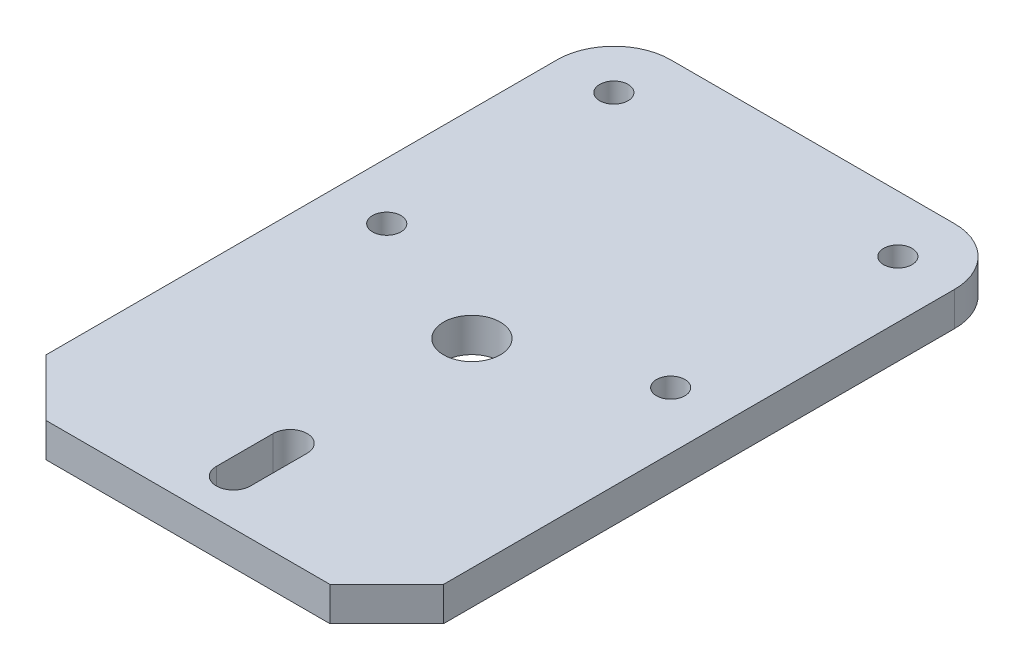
ISO-10303-21;
HEADER;
FILE_DESCRIPTION(('STEP AP214'),'2;1');
FILE_NAME('part.step','',(''),(''),'','','');
FILE_SCHEMA(('AUTOMOTIVE_DESIGN { 1 0 10303 214 1 1 1 1 }'));
ENDSEC;
DATA;
#1=APPLICATION_CONTEXT('core data for automotive mechanical design processes');
#2=APPLICATION_PROTOCOL_DEFINITION('international standard','automotive_design',2000,#1);
#3=PRODUCT_CONTEXT('',#1,'mechanical');
#4=PRODUCT('Part','Part','',(#3));
#5=PRODUCT_RELATED_PRODUCT_CATEGORY('part','',(#4));
#6=PRODUCT_DEFINITION_FORMATION('','',#4);
#7=PRODUCT_DEFINITION_CONTEXT('part definition',#1,'design');
#8=PRODUCT_DEFINITION('design','',#6,#7);
#9=PRODUCT_DEFINITION_SHAPE('','',#8);
#10=(LENGTH_UNIT() NAMED_UNIT(*) SI_UNIT(.MILLI.,.METRE.));
#11=(NAMED_UNIT(*) PLANE_ANGLE_UNIT() SI_UNIT($,.RADIAN.));
#12=(NAMED_UNIT(*) SI_UNIT($,.STERADIAN.) SOLID_ANGLE_UNIT());
#13=UNCERTAINTY_MEASURE_WITH_UNIT(LENGTH_MEASURE(1.E-05),#10,'distance_accuracy_value','');
#14=(GEOMETRIC_REPRESENTATION_CONTEXT(3) GLOBAL_UNCERTAINTY_ASSIGNED_CONTEXT((#13)) GLOBAL_UNIT_ASSIGNED_CONTEXT((#10,
#11,#12)) REPRESENTATION_CONTEXT('',''));
#15=CARTESIAN_POINT('',(0.,0.,0.));
#16=DIRECTION('',(0.,0.,1.));
#17=DIRECTION('',(1.,0.,0.));
#18=AXIS2_PLACEMENT_3D('',#15,#16,#17);
#19=CARTESIAN_POINT('',(10.,6.,-100.));
#20=DIRECTION('',(0.,-1.,0.));
#21=DIRECTION('',(0.,0.,-1.));
#22=AXIS2_PLACEMENT_3D('',#19,#20,#21);
#23=PLANE('',#22);
#24=CARTESIAN_POINT('',(60.,6.,-60.));
#25=DIRECTION('',(0.,1.,0.));
#26=DIRECTION('',(0.,0.,1.));
#27=AXIS2_PLACEMENT_3D('',#24,#25,#26);
#28=CIRCLE('',#27,2.5);
#29=CARTESIAN_POINT('',(60.,6.,-57.5));
#30=VERTEX_POINT('',#29);
#31=EDGE_CURVE('E325',#30,#30,#28,.T.);
#32=ORIENTED_EDGE('',*,*,#31,.F.);
#33=EDGE_LOOP('',(#32));
#34=FACE_BOUND('',#33,.T.);
#35=CARTESIAN_POINT('',(60.,6.,-100.));
#36=DIRECTION('',(0.,1.,0.));
#37=DIRECTION('',(0.,0.,1.));
#38=AXIS2_PLACEMENT_3D('',#35,#36,#37);
#39=CIRCLE('',#38,2.5);
#40=CARTESIAN_POINT('',(60.,6.,-97.5));
#41=VERTEX_POINT('',#40);
#42=EDGE_CURVE('E337',#41,#41,#39,.T.);
#43=ORIENTED_EDGE('',*,*,#42,.F.);
#44=EDGE_LOOP('',(#43));
#45=FACE_BOUND('',#44,.T.);
#46=CARTESIAN_POINT('',(35.,6.,-18.));
#47=DIRECTION('',(0.,1.,0.));
#48=DIRECTION('',(0.,0.,1.));
#49=AXIS2_PLACEMENT_3D('',#46,#47,#48);
#50=CIRCLE('',#49,3.);
#51=CARTESIAN_POINT('',(38.,6.,-18.));
#52=VERTEX_POINT('',#51);
#53=CARTESIAN_POINT('',(32.,6.,-18.));
#54=VERTEX_POINT('',#53);
#55=EDGE_CURVE('E136',#52,#54,#50,.T.);
#56=ORIENTED_EDGE('',*,*,#55,.F.);
#57=DIRECTION('',(0.,0.,-1.));
#58=VECTOR('',#57,1.);
#59=CARTESIAN_POINT('',(38.,6.,-18.));
#60=LINE('',#59,#58);
#61=CARTESIAN_POINT('',(38.,6.,-8.00000000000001));
#62=VERTEX_POINT('',#61);
#63=EDGE_CURVE('E157',#62,#52,#60,.T.);
#64=ORIENTED_EDGE('',*,*,#63,.F.);
#65=CARTESIAN_POINT('',(35.,6.,-8.));
#66=DIRECTION('',(0.,1.,0.));
#67=DIRECTION('',(0.,0.,1.));
#68=AXIS2_PLACEMENT_3D('',#65,#66,#67);
#69=CIRCLE('',#68,3.);
#70=CARTESIAN_POINT('',(32.,6.,-8.));
#71=VERTEX_POINT('',#70);
#72=EDGE_CURVE('E155',#71,#62,#69,.T.);
#73=ORIENTED_EDGE('',*,*,#72,.F.);
#74=DIRECTION('',(0.,0.,1.));
#75=VECTOR('',#74,1.);
#76=CARTESIAN_POINT('',(32.,6.,-18.));
#77=LINE('',#76,#75);
#78=EDGE_CURVE('E153',#54,#71,#77,.T.);
#79=ORIENTED_EDGE('',*,*,#78,.F.);
#80=EDGE_LOOP('',(#56,#64,#73,#79));
#81=FACE_BOUND('',#80,.T.);
#82=CARTESIAN_POINT('',(10.,6.,-100.));
#83=DIRECTION('',(0.,1.,0.));
#84=DIRECTION('',(0.,0.,-1.));
#85=AXIS2_PLACEMENT_3D('',#82,#83,#84);
#86=CIRCLE('',#85,10.);
#87=CARTESIAN_POINT('',(10.0000000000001,6.,-110.));
#88=VERTEX_POINT('',#87);
#89=CARTESIAN_POINT('',(0.,6.,-99.9999999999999));
#90=VERTEX_POINT('',#89);
#91=EDGE_CURVE('E179',#88,#90,#86,.T.);
#92=ORIENTED_EDGE('',*,*,#91,.T.);
#93=DIRECTION('',(0.,0.,1.));
#94=VECTOR('',#93,1.);
#95=CARTESIAN_POINT('',(0.,6.,-10.));
#96=LINE('',#95,#94);
#97=CARTESIAN_POINT('',(0.,6.,-10.));
#98=VERTEX_POINT('',#97);
#99=EDGE_CURVE('E182',#90,#98,#96,.T.);
#100=ORIENTED_EDGE('',*,*,#99,.T.);
#101=DIRECTION('',(0.707106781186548,0.,0.707106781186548));
#102=VECTOR('',#101,1.);
#103=CARTESIAN_POINT('',(0.,6.,-10.));
#104=LINE('',#103,#102);
#105=CARTESIAN_POINT('',(10.,6.,0.));
#106=VERTEX_POINT('',#105);
#107=EDGE_CURVE('E184',#98,#106,#104,.T.);
#108=ORIENTED_EDGE('',*,*,#107,.T.);
#109=DIRECTION('',(1.,0.,0.));
#110=VECTOR('',#109,1.);
#111=CARTESIAN_POINT('',(10.,6.,0.));
#112=LINE('',#111,#110);
#113=CARTESIAN_POINT('',(60.,6.,0.));
#114=VERTEX_POINT('',#113);
#115=EDGE_CURVE('E186',#106,#114,#112,.T.);
#116=ORIENTED_EDGE('',*,*,#115,.T.);
#117=DIRECTION('',(0.707106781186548,0.,-0.707106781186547));
#118=VECTOR('',#117,1.);
#119=CARTESIAN_POINT('',(60.,6.,0.));
#120=LINE('',#119,#118);
#121=CARTESIAN_POINT('',(70.,6.,-10.));
#122=VERTEX_POINT('',#121);
#123=EDGE_CURVE('E188',#114,#122,#120,.T.);
#124=ORIENTED_EDGE('',*,*,#123,.T.);
#125=DIRECTION('',(0.,0.,-1.));
#126=VECTOR('',#125,1.);
#127=CARTESIAN_POINT('',(70.,6.,-10.));
#128=LINE('',#127,#126);
#129=CARTESIAN_POINT('',(70.,6.,-99.9999999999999));
#130=VERTEX_POINT('',#129);
#131=EDGE_CURVE('E190',#122,#130,#128,.T.);
#132=ORIENTED_EDGE('',*,*,#131,.T.);
#133=CARTESIAN_POINT('',(60.,6.,-100.));
#134=DIRECTION('',(0.,1.,0.));
#135=DIRECTION('',(0.,0.,1.));
#136=AXIS2_PLACEMENT_3D('',#133,#134,#135);
#137=CIRCLE('',#136,9.99999999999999);
#138=CARTESIAN_POINT('',(59.9999999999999,6.,-110.));
#139=VERTEX_POINT('',#138);
#140=EDGE_CURVE('E192',#130,#139,#137,.T.);
#141=ORIENTED_EDGE('',*,*,#140,.T.);
#142=DIRECTION('',(-1.,0.,0.));
#143=VECTOR('',#142,1.);
#144=CARTESIAN_POINT('',(10.0000000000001,6.,-110.));
#145=LINE('',#144,#143);
#146=EDGE_CURVE('E194',#139,#88,#145,.T.);
#147=ORIENTED_EDGE('',*,*,#146,.T.);
#148=EDGE_LOOP('',(#92,#100,#108,#116,#124,#132,#141,#147));
#149=FACE_BOUND('',#148,.T.);
#150=CARTESIAN_POINT('',(10.,6.,-100.));
#151=DIRECTION('',(0.,1.,0.));
#152=DIRECTION('',(0.,0.,1.));
#153=AXIS2_PLACEMENT_3D('',#150,#151,#152);
#154=CIRCLE('',#153,2.5);
#155=CARTESIAN_POINT('',(10.,6.,-97.5));
#156=VERTEX_POINT('',#155);
#157=EDGE_CURVE('E143',#156,#156,#154,.T.);
#158=ORIENTED_EDGE('',*,*,#157,.F.);
#159=EDGE_LOOP('',(#158));
#160=FACE_BOUND('',#159,.T.);
#161=CARTESIAN_POINT('',(10.,6.,-60.));
#162=DIRECTION('',(0.,1.,0.));
#163=DIRECTION('',(0.,0.,1.));
#164=AXIS2_PLACEMENT_3D('',#161,#162,#163);
#165=CIRCLE('',#164,2.5);
#166=CARTESIAN_POINT('',(10.,6.,-57.5));
#167=VERTEX_POINT('',#166);
#168=EDGE_CURVE('E331',#167,#167,#165,.T.);
#169=ORIENTED_EDGE('',*,*,#168,.F.);
#170=EDGE_LOOP('',(#169));
#171=FACE_BOUND('',#170,.T.);
#172=CARTESIAN_POINT('',(35.,6.,-50.));
#173=DIRECTION('',(0.,1.,0.));
#174=DIRECTION('',(0.,0.,1.));
#175=AXIS2_PLACEMENT_3D('',#172,#173,#174);
#176=CIRCLE('',#175,5.);
#177=CARTESIAN_POINT('',(35.,6.,-45.));
#178=VERTEX_POINT('',#177);
#179=EDGE_CURVE('E314',#178,#178,#176,.T.);
#180=ORIENTED_EDGE('',*,*,#179,.F.);
#181=EDGE_LOOP('',(#180));
#182=FACE_BOUND('',#181,.T.);
#183=ADVANCED_FACE('F32',(#34,#45,#81,#149,#160,#171,#182),#23,.F.);
#184=CARTESIAN_POINT('',(10.,0.,-100.));
#185=DIRECTION('',(0.,-1.,0.));
#186=DIRECTION('',(0.,0.,-1.));
#187=AXIS2_PLACEMENT_3D('',#184,#185,#186);
#188=PLANE('',#187);
#189=CARTESIAN_POINT('',(60.,0.,-60.));
#190=DIRECTION('',(0.,1.,0.));
#191=DIRECTION('',(0.,0.,1.));
#192=AXIS2_PLACEMENT_3D('',#189,#190,#191);
#193=CIRCLE('',#192,2.5);
#194=CARTESIAN_POINT('',(60.,0.,-57.5));
#195=VERTEX_POINT('',#194);
#196=EDGE_CURVE('E320',#195,#195,#193,.T.);
#197=ORIENTED_EDGE('',*,*,#196,.T.);
#198=EDGE_LOOP('',(#197));
#199=FACE_BOUND('',#198,.T.);
#200=CARTESIAN_POINT('',(60.,0.,-100.));
#201=DIRECTION('',(0.,1.,0.));
#202=DIRECTION('',(0.,0.,1.));
#203=AXIS2_PLACEMENT_3D('',#200,#201,#202);
#204=CIRCLE('',#203,2.5);
#205=CARTESIAN_POINT('',(60.,0.,-97.5));
#206=VERTEX_POINT('',#205);
#207=EDGE_CURVE('E334',#206,#206,#204,.T.);
#208=ORIENTED_EDGE('',*,*,#207,.T.);
#209=EDGE_LOOP('',(#208));
#210=FACE_BOUND('',#209,.T.);
#211=DIRECTION('',(0.,0.,-1.));
#212=VECTOR('',#211,1.);
#213=CARTESIAN_POINT('',(38.,0.,-18.));
#214=LINE('',#213,#212);
#215=CARTESIAN_POINT('',(38.,0.,-8.));
#216=VERTEX_POINT('',#215);
#217=CARTESIAN_POINT('',(38.,0.,-18.));
#218=VERTEX_POINT('',#217);
#219=EDGE_CURVE('E142',#216,#218,#214,.T.);
#220=ORIENTED_EDGE('',*,*,#219,.T.);
#221=CARTESIAN_POINT('',(35.,0.,-18.));
#222=DIRECTION('',(0.,1.,0.));
#223=DIRECTION('',(0.,0.,1.));
#224=AXIS2_PLACEMENT_3D('',#221,#222,#223);
#225=CIRCLE('',#224,3.);
#226=CARTESIAN_POINT('',(32.,0.,-18.));
#227=VERTEX_POINT('',#226);
#228=EDGE_CURVE('E55',#218,#227,#225,.T.);
#229=ORIENTED_EDGE('',*,*,#228,.T.);
#230=DIRECTION('',(0.,0.,1.));
#231=VECTOR('',#230,1.);
#232=CARTESIAN_POINT('',(32.,0.,-18.));
#233=LINE('',#232,#231);
#234=CARTESIAN_POINT('',(32.,0.,-8.));
#235=VERTEX_POINT('',#234);
#236=EDGE_CURVE('E123',#227,#235,#233,.T.);
#237=ORIENTED_EDGE('',*,*,#236,.T.);
#238=CARTESIAN_POINT('',(35.,0.,-8.));
#239=DIRECTION('',(0.,1.,0.));
#240=DIRECTION('',(0.,0.,1.));
#241=AXIS2_PLACEMENT_3D('',#238,#239,#240);
#242=CIRCLE('',#241,3.);
#243=EDGE_CURVE('E132',#235,#216,#242,.T.);
#244=ORIENTED_EDGE('',*,*,#243,.T.);
#245=EDGE_LOOP('',(#220,#229,#237,#244));
#246=FACE_BOUND('',#245,.T.);
#247=CARTESIAN_POINT('',(10.,0.,-100.));
#248=DIRECTION('',(0.,1.,0.));
#249=DIRECTION('',(0.,0.,-1.));
#250=AXIS2_PLACEMENT_3D('',#247,#248,#249);
#251=CIRCLE('',#250,10.);
#252=CARTESIAN_POINT('',(10.0000000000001,0.,-110.));
#253=VERTEX_POINT('',#252);
#254=CARTESIAN_POINT('',(0.,0.,-99.9999999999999));
#255=VERTEX_POINT('',#254);
#256=EDGE_CURVE('E137',#253,#255,#251,.T.);
#257=ORIENTED_EDGE('',*,*,#256,.F.);
#258=DIRECTION('',(-1.,0.,0.));
#259=VECTOR('',#258,1.);
#260=CARTESIAN_POINT('',(10.0000000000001,0.,-110.));
#261=LINE('',#260,#259);
#262=CARTESIAN_POINT('',(59.9999999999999,0.,-110.));
#263=VERTEX_POINT('',#262);
#264=EDGE_CURVE('E177',#263,#253,#261,.T.);
#265=ORIENTED_EDGE('',*,*,#264,.F.);
#266=CARTESIAN_POINT('',(60.,0.,-100.));
#267=DIRECTION('',(0.,1.,0.));
#268=DIRECTION('',(0.,0.,1.));
#269=AXIS2_PLACEMENT_3D('',#266,#267,#268);
#270=CIRCLE('',#269,9.99999999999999);
#271=CARTESIAN_POINT('',(70.,0.,-99.9999999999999));
#272=VERTEX_POINT('',#271);
#273=EDGE_CURVE('E175',#272,#263,#270,.T.);
#274=ORIENTED_EDGE('',*,*,#273,.F.);
#275=DIRECTION('',(0.,0.,-1.));
#276=VECTOR('',#275,1.);
#277=CARTESIAN_POINT('',(70.,0.,-10.));
#278=LINE('',#277,#276);
#279=CARTESIAN_POINT('',(70.,0.,-10.));
#280=VERTEX_POINT('',#279);
#281=EDGE_CURVE('E173',#280,#272,#278,.T.);
#282=ORIENTED_EDGE('',*,*,#281,.F.);
#283=DIRECTION('',(0.707106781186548,0.,-0.707106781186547));
#284=VECTOR('',#283,1.);
#285=CARTESIAN_POINT('',(60.,0.,0.));
#286=LINE('',#285,#284);
#287=CARTESIAN_POINT('',(60.,0.,0.));
#288=VERTEX_POINT('',#287);
#289=EDGE_CURVE('E171',#288,#280,#286,.T.);
#290=ORIENTED_EDGE('',*,*,#289,.F.);
#291=DIRECTION('',(1.,0.,0.));
#292=VECTOR('',#291,1.);
#293=CARTESIAN_POINT('',(10.,0.,0.));
#294=LINE('',#293,#292);
#295=CARTESIAN_POINT('',(10.,0.,0.));
#296=VERTEX_POINT('',#295);
#297=EDGE_CURVE('E169',#296,#288,#294,.T.);
#298=ORIENTED_EDGE('',*,*,#297,.F.);
#299=DIRECTION('',(0.707106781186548,0.,0.707106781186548));
#300=VECTOR('',#299,1.);
#301=CARTESIAN_POINT('',(0.,0.,-10.));
#302=LINE('',#301,#300);
#303=CARTESIAN_POINT('',(0.,0.,-10.));
#304=VERTEX_POINT('',#303);
#305=EDGE_CURVE('E167',#304,#296,#302,.T.);
#306=ORIENTED_EDGE('',*,*,#305,.F.);
#307=DIRECTION('',(0.,0.,1.));
#308=VECTOR('',#307,1.);
#309=CARTESIAN_POINT('',(0.,0.,-10.));
#310=LINE('',#309,#308);
#311=EDGE_CURVE('E165',#255,#304,#310,.T.);
#312=ORIENTED_EDGE('',*,*,#311,.F.);
#313=EDGE_LOOP('',(#257,#265,#274,#282,#290,#298,#306,#312));
#314=FACE_BOUND('',#313,.T.);
#315=CARTESIAN_POINT('',(10.,0.,-100.));
#316=DIRECTION('',(0.,1.,0.));
#317=DIRECTION('',(0.,0.,1.));
#318=AXIS2_PLACEMENT_3D('',#315,#316,#317);
#319=CIRCLE('',#318,2.5);
#320=CARTESIAN_POINT('',(10.,0.,-97.5));
#321=VERTEX_POINT('',#320);
#322=EDGE_CURVE('E146',#321,#321,#319,.T.);
#323=ORIENTED_EDGE('',*,*,#322,.T.);
#324=EDGE_LOOP('',(#323));
#325=FACE_BOUND('',#324,.T.);
#326=CARTESIAN_POINT('',(10.,0.,-60.));
#327=DIRECTION('',(0.,1.,0.));
#328=DIRECTION('',(0.,0.,1.));
#329=AXIS2_PLACEMENT_3D('',#326,#327,#328);
#330=CIRCLE('',#329,2.5);
#331=CARTESIAN_POINT('',(10.,0.,-57.5));
#332=VERTEX_POINT('',#331);
#333=EDGE_CURVE('E328',#332,#332,#330,.T.);
#334=ORIENTED_EDGE('',*,*,#333,.T.);
#335=EDGE_LOOP('',(#334));
#336=FACE_BOUND('',#335,.T.);
#337=CARTESIAN_POINT('',(35.,0.,-50.));
#338=DIRECTION('',(0.,1.,0.));
#339=DIRECTION('',(0.,0.,1.));
#340=AXIS2_PLACEMENT_3D('',#337,#338,#339);
#341=CIRCLE('',#340,5.);
#342=CARTESIAN_POINT('',(35.,0.,-45.));
#343=VERTEX_POINT('',#342);
#344=EDGE_CURVE('E317',#343,#343,#341,.T.);
#345=ORIENTED_EDGE('',*,*,#344,.T.);
#346=EDGE_LOOP('',(#345));
#347=FACE_BOUND('',#346,.T.);
#348=ADVANCED_FACE('F140',(#199,#210,#246,#314,#325,#336,#347),#188,.T.);
#349=CARTESIAN_POINT('',(10.,6.,-100.));
#350=DIRECTION('',(0.,-1.,0.));
#351=DIRECTION('',(0.,0.,-1.));
#352=AXIS2_PLACEMENT_3D('',#349,#350,#351);
#353=CYLINDRICAL_SURFACE('',#352,10.);
#354=ORIENTED_EDGE('',*,*,#256,.T.);
#355=DIRECTION('',(0.,-1.,0.));
#356=VECTOR('',#355,1.);
#357=CARTESIAN_POINT('',(0.,6.,-99.9999999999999));
#358=LINE('',#357,#356);
#359=EDGE_CURVE('E11',#90,#255,#358,.T.);
#360=ORIENTED_EDGE('',*,*,#359,.F.);
#361=ORIENTED_EDGE('',*,*,#91,.F.);
#362=DIRECTION('',(0.,-1.,0.));
#363=VECTOR('',#362,1.);
#364=CARTESIAN_POINT('',(10.0000000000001,6.,-110.));
#365=LINE('',#364,#363);
#366=EDGE_CURVE('E196',#88,#253,#365,.T.);
#367=ORIENTED_EDGE('',*,*,#366,.T.);
#368=EDGE_LOOP('',(#354,#360,#361,#367));
#369=FACE_BOUND('',#368,.T.);
#370=ADVANCED_FACE('F34',(#369),#353,.T.);
#371=CARTESIAN_POINT('',(0.,6.,-10.));
#372=DIRECTION('',(1.,0.,0.));
#373=DIRECTION('',(0.,0.,-1.));
#374=AXIS2_PLACEMENT_3D('',#371,#372,#373);
#375=PLANE('',#374);
#376=ORIENTED_EDGE('',*,*,#311,.T.);
#377=DIRECTION('',(0.,-1.,0.));
#378=VECTOR('',#377,1.);
#379=CARTESIAN_POINT('',(0.,6.,-10.));
#380=LINE('',#379,#378);
#381=EDGE_CURVE('E40',#98,#304,#380,.T.);
#382=ORIENTED_EDGE('',*,*,#381,.F.);
#383=ORIENTED_EDGE('',*,*,#99,.F.);
#384=ORIENTED_EDGE('',*,*,#359,.T.);
#385=EDGE_LOOP('',(#376,#382,#383,#384));
#386=FACE_BOUND('',#385,.T.);
#387=ADVANCED_FACE('F240',(#386),#375,.F.);
#388=CARTESIAN_POINT('',(0.,6.,-10.));
#389=DIRECTION('',(0.707106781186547,0.,-0.707106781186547));
#390=DIRECTION('',(-0.707106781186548,0.,-0.707106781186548));
#391=AXIS2_PLACEMENT_3D('',#388,#389,#390);
#392=PLANE('',#391);
#393=ORIENTED_EDGE('',*,*,#305,.T.);
#394=DIRECTION('',(0.,-1.,0.));
#395=VECTOR('',#394,1.);
#396=CARTESIAN_POINT('',(10.,6.,0.));
#397=LINE('',#396,#395);
#398=EDGE_CURVE('E211',#106,#296,#397,.T.);
#399=ORIENTED_EDGE('',*,*,#398,.F.);
#400=ORIENTED_EDGE('',*,*,#107,.F.);
#401=ORIENTED_EDGE('',*,*,#381,.T.);
#402=EDGE_LOOP('',(#393,#399,#400,#401));
#403=FACE_BOUND('',#402,.T.);
#404=ADVANCED_FACE('F218',(#403),#392,.F.);
#405=CARTESIAN_POINT('',(10.,6.,0.));
#406=DIRECTION('',(0.,0.,-1.));
#407=DIRECTION('',(-1.,0.,0.));
#408=AXIS2_PLACEMENT_3D('',#405,#406,#407);
#409=PLANE('',#408);
#410=ORIENTED_EDGE('',*,*,#297,.T.);
#411=DIRECTION('',(0.,-1.,0.));
#412=VECTOR('',#411,1.);
#413=CARTESIAN_POINT('',(60.,6.,0.));
#414=LINE('',#413,#412);
#415=EDGE_CURVE('E208',#114,#288,#414,.T.);
#416=ORIENTED_EDGE('',*,*,#415,.F.);
#417=ORIENTED_EDGE('',*,*,#115,.F.);
#418=ORIENTED_EDGE('',*,*,#398,.T.);
#419=EDGE_LOOP('',(#410,#416,#417,#418));
#420=FACE_BOUND('',#419,.T.);
#421=ADVANCED_FACE('F228',(#420),#409,.F.);
#422=CARTESIAN_POINT('',(60.,6.,0.));
#423=DIRECTION('',(-0.707106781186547,0.,-0.707106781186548));
#424=DIRECTION('',(-0.707106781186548,0.,0.707106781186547));
#425=AXIS2_PLACEMENT_3D('',#422,#423,#424);
#426=PLANE('',#425);
#427=ORIENTED_EDGE('',*,*,#289,.T.);
#428=DIRECTION('',(0.,-1.,0.));
#429=VECTOR('',#428,1.);
#430=CARTESIAN_POINT('',(70.,6.,-10.));
#431=LINE('',#430,#429);
#432=EDGE_CURVE('E205',#122,#280,#431,.T.);
#433=ORIENTED_EDGE('',*,*,#432,.F.);
#434=ORIENTED_EDGE('',*,*,#123,.F.);
#435=ORIENTED_EDGE('',*,*,#415,.T.);
#436=EDGE_LOOP('',(#427,#433,#434,#435));
#437=FACE_BOUND('',#436,.T.);
#438=ADVANCED_FACE('F232',(#437),#426,.F.);
#439=CARTESIAN_POINT('',(70.,6.,-10.));
#440=DIRECTION('',(-1.,0.,0.));
#441=DIRECTION('',(0.,0.,1.));
#442=AXIS2_PLACEMENT_3D('',#439,#440,#441);
#443=PLANE('',#442);
#444=ORIENTED_EDGE('',*,*,#281,.T.);
#445=DIRECTION('',(0.,-1.,0.));
#446=VECTOR('',#445,1.);
#447=CARTESIAN_POINT('',(70.,6.,-99.9999999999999));
#448=LINE('',#447,#446);
#449=EDGE_CURVE('E202',#130,#272,#448,.T.);
#450=ORIENTED_EDGE('',*,*,#449,.F.);
#451=ORIENTED_EDGE('',*,*,#131,.F.);
#452=ORIENTED_EDGE('',*,*,#432,.T.);
#453=EDGE_LOOP('',(#444,#450,#451,#452));
#454=FACE_BOUND('',#453,.T.);
#455=ADVANCED_FACE('F253',(#454),#443,.F.);
#456=CARTESIAN_POINT('',(60.,6.,-100.));
#457=DIRECTION('',(0.,-1.,0.));
#458=DIRECTION('',(0.,0.,-1.));
#459=AXIS2_PLACEMENT_3D('',#456,#457,#458);
#460=CYLINDRICAL_SURFACE('',#459,9.99999999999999);
#461=ORIENTED_EDGE('',*,*,#273,.T.);
#462=DIRECTION('',(0.,-1.,0.));
#463=VECTOR('',#462,1.);
#464=CARTESIAN_POINT('',(59.9999999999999,6.,-110.));
#465=LINE('',#464,#463);
#466=EDGE_CURVE('E199',#139,#263,#465,.T.);
#467=ORIENTED_EDGE('',*,*,#466,.F.);
#468=ORIENTED_EDGE('',*,*,#140,.F.);
#469=ORIENTED_EDGE('',*,*,#449,.T.);
#470=EDGE_LOOP('',(#461,#467,#468,#469));
#471=FACE_BOUND('',#470,.T.);
#472=ADVANCED_FACE('F251',(#471),#460,.T.);
#473=CARTESIAN_POINT('',(10.0000000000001,6.,-110.));
#474=DIRECTION('',(0.,0.,1.));
#475=DIRECTION('',(1.,0.,0.));
#476=AXIS2_PLACEMENT_3D('',#473,#474,#475);
#477=PLANE('',#476);
#478=ORIENTED_EDGE('',*,*,#264,.T.);
#479=ORIENTED_EDGE('',*,*,#366,.F.);
#480=ORIENTED_EDGE('',*,*,#146,.F.);
#481=ORIENTED_EDGE('',*,*,#466,.T.);
#482=EDGE_LOOP('',(#478,#479,#480,#481));
#483=FACE_BOUND('',#482,.T.);
#484=ADVANCED_FACE('F246',(#483),#477,.F.);
#485=CARTESIAN_POINT('',(35.,6.,-18.));
#486=DIRECTION('',(0.,-1.,0.));
#487=DIRECTION('',(0.,0.,-1.));
#488=AXIS2_PLACEMENT_3D('',#485,#486,#487);
#489=CYLINDRICAL_SURFACE('',#488,3.);
#490=ORIENTED_EDGE('',*,*,#228,.F.);
#491=DIRECTION('',(0.,-1.,0.));
#492=VECTOR('',#491,1.);
#493=CARTESIAN_POINT('',(38.,6.,-18.));
#494=LINE('',#493,#492);
#495=EDGE_CURVE('E159',#52,#218,#494,.T.);
#496=ORIENTED_EDGE('',*,*,#495,.F.);
#497=ORIENTED_EDGE('',*,*,#55,.T.);
#498=DIRECTION('',(0.,-1.,0.));
#499=VECTOR('',#498,1.);
#500=CARTESIAN_POINT('',(32.,6.,-18.));
#501=LINE('',#500,#499);
#502=EDGE_CURVE('E125',#54,#227,#501,.T.);
#503=ORIENTED_EDGE('',*,*,#502,.T.);
#504=EDGE_LOOP('',(#490,#496,#497,#503));
#505=FACE_BOUND('',#504,.T.);
#506=ADVANCED_FACE('F134',(#505),#489,.F.);
#507=CARTESIAN_POINT('',(32.,6.,-18.));
#508=DIRECTION('',(1.,0.,0.));
#509=DIRECTION('',(0.,0.,-1.));
#510=AXIS2_PLACEMENT_3D('',#507,#508,#509);
#511=PLANE('',#510);
#512=ORIENTED_EDGE('',*,*,#236,.F.);
#513=ORIENTED_EDGE('',*,*,#502,.F.);
#514=ORIENTED_EDGE('',*,*,#78,.T.);
#515=DIRECTION('',(0.,-1.,0.));
#516=VECTOR('',#515,1.);
#517=CARTESIAN_POINT('',(32.,6.,-8.));
#518=LINE('',#517,#516);
#519=EDGE_CURVE('E128',#71,#235,#518,.T.);
#520=ORIENTED_EDGE('',*,*,#519,.T.);
#521=EDGE_LOOP('',(#512,#513,#514,#520));
#522=FACE_BOUND('',#521,.T.);
#523=ADVANCED_FACE('F124',(#522),#511,.T.);
#524=CARTESIAN_POINT('',(35.,6.,-8.));
#525=DIRECTION('',(0.,-1.,0.));
#526=DIRECTION('',(0.,0.,-1.));
#527=AXIS2_PLACEMENT_3D('',#524,#525,#526);
#528=CYLINDRICAL_SURFACE('',#527,3.);
#529=ORIENTED_EDGE('',*,*,#243,.F.);
#530=ORIENTED_EDGE('',*,*,#519,.F.);
#531=ORIENTED_EDGE('',*,*,#72,.T.);
#532=DIRECTION('',(0.,-1.,0.));
#533=VECTOR('',#532,1.);
#534=CARTESIAN_POINT('',(38.,6.,-8.));
#535=LINE('',#534,#533);
#536=EDGE_CURVE('E47',#62,#216,#535,.T.);
#537=ORIENTED_EDGE('',*,*,#536,.T.);
#538=EDGE_LOOP('',(#529,#530,#531,#537));
#539=FACE_BOUND('',#538,.T.);
#540=ADVANCED_FACE('F281',(#539),#528,.F.);
#541=CARTESIAN_POINT('',(38.,6.,-18.));
#542=DIRECTION('',(-1.,0.,0.));
#543=DIRECTION('',(0.,0.,1.));
#544=AXIS2_PLACEMENT_3D('',#541,#542,#543);
#545=PLANE('',#544);
#546=ORIENTED_EDGE('',*,*,#219,.F.);
#547=ORIENTED_EDGE('',*,*,#536,.F.);
#548=ORIENTED_EDGE('',*,*,#63,.T.);
#549=ORIENTED_EDGE('',*,*,#495,.T.);
#550=EDGE_LOOP('',(#546,#547,#548,#549));
#551=FACE_BOUND('',#550,.T.);
#552=ADVANCED_FACE('F286',(#551),#545,.T.);
#553=CARTESIAN_POINT('',(10.,6.,-100.));
#554=DIRECTION('',(0.,-1.,0.));
#555=DIRECTION('',(0.,0.,-1.));
#556=AXIS2_PLACEMENT_3D('',#553,#554,#555);
#557=CYLINDRICAL_SURFACE('',#556,2.5);
#558=ORIENTED_EDGE('',*,*,#157,.T.);
#559=EDGE_LOOP('',(#558));
#560=FACE_BOUND('',#559,.T.);
#561=ORIENTED_EDGE('',*,*,#322,.F.);
#562=EDGE_LOOP('',(#561));
#563=FACE_BOUND('',#562,.T.);
#564=ADVANCED_FACE('F290',(#560,#563),#557,.F.);
#565=CARTESIAN_POINT('',(60.,6.,-100.));
#566=DIRECTION('',(0.,-1.,0.));
#567=DIRECTION('',(0.,0.,-1.));
#568=AXIS2_PLACEMENT_3D('',#565,#566,#567);
#569=CYLINDRICAL_SURFACE('',#568,2.5);
#570=ORIENTED_EDGE('',*,*,#42,.T.);
#571=EDGE_LOOP('',(#570));
#572=FACE_BOUND('',#571,.T.);
#573=ORIENTED_EDGE('',*,*,#207,.F.);
#574=EDGE_LOOP('',(#573));
#575=FACE_BOUND('',#574,.T.);
#576=ADVANCED_FACE('F293',(#572,#575),#569,.F.);
#577=CARTESIAN_POINT('',(10.,6.,-60.));
#578=DIRECTION('',(0.,-1.,0.));
#579=DIRECTION('',(0.,0.,-1.));
#580=AXIS2_PLACEMENT_3D('',#577,#578,#579);
#581=CYLINDRICAL_SURFACE('',#580,2.5);
#582=ORIENTED_EDGE('',*,*,#168,.T.);
#583=EDGE_LOOP('',(#582));
#584=FACE_BOUND('',#583,.T.);
#585=ORIENTED_EDGE('',*,*,#333,.F.);
#586=EDGE_LOOP('',(#585));
#587=FACE_BOUND('',#586,.T.);
#588=ADVANCED_FACE('F297',(#584,#587),#581,.F.);
#589=CARTESIAN_POINT('',(60.,6.,-60.));
#590=DIRECTION('',(0.,-1.,0.));
#591=DIRECTION('',(0.,0.,-1.));
#592=AXIS2_PLACEMENT_3D('',#589,#590,#591);
#593=CYLINDRICAL_SURFACE('',#592,2.5);
#594=ORIENTED_EDGE('',*,*,#31,.T.);
#595=EDGE_LOOP('',(#594));
#596=FACE_BOUND('',#595,.T.);
#597=ORIENTED_EDGE('',*,*,#196,.F.);
#598=EDGE_LOOP('',(#597));
#599=FACE_BOUND('',#598,.T.);
#600=ADVANCED_FACE('F301',(#596,#599),#593,.F.);
#601=CARTESIAN_POINT('',(35.,6.,-50.));
#602=DIRECTION('',(0.,-1.,0.));
#603=DIRECTION('',(0.,0.,-1.));
#604=AXIS2_PLACEMENT_3D('',#601,#602,#603);
#605=CYLINDRICAL_SURFACE('',#604,5.);
#606=ORIENTED_EDGE('',*,*,#179,.T.);
#607=EDGE_LOOP('',(#606));
#608=FACE_BOUND('',#607,.T.);
#609=ORIENTED_EDGE('',*,*,#344,.F.);
#610=EDGE_LOOP('',(#609));
#611=FACE_BOUND('',#610,.T.);
#612=ADVANCED_FACE('F305',(#608,#611),#605,.F.);
#613=CLOSED_SHELL('',(#183,#348,#370,#387,#404,#421,#438,#455,#472,#484,#506,#523,#540,#552,
#564,#576,#588,#600,#612));
#614=MANIFOLD_SOLID_BREP('B2',#613);
#615=ADVANCED_BREP_SHAPE_REPRESENTATION('',(#18,#614),#14);
#616=SHAPE_DEFINITION_REPRESENTATION(#9,#615);
ENDSEC;
END-ISO-10303-21;
